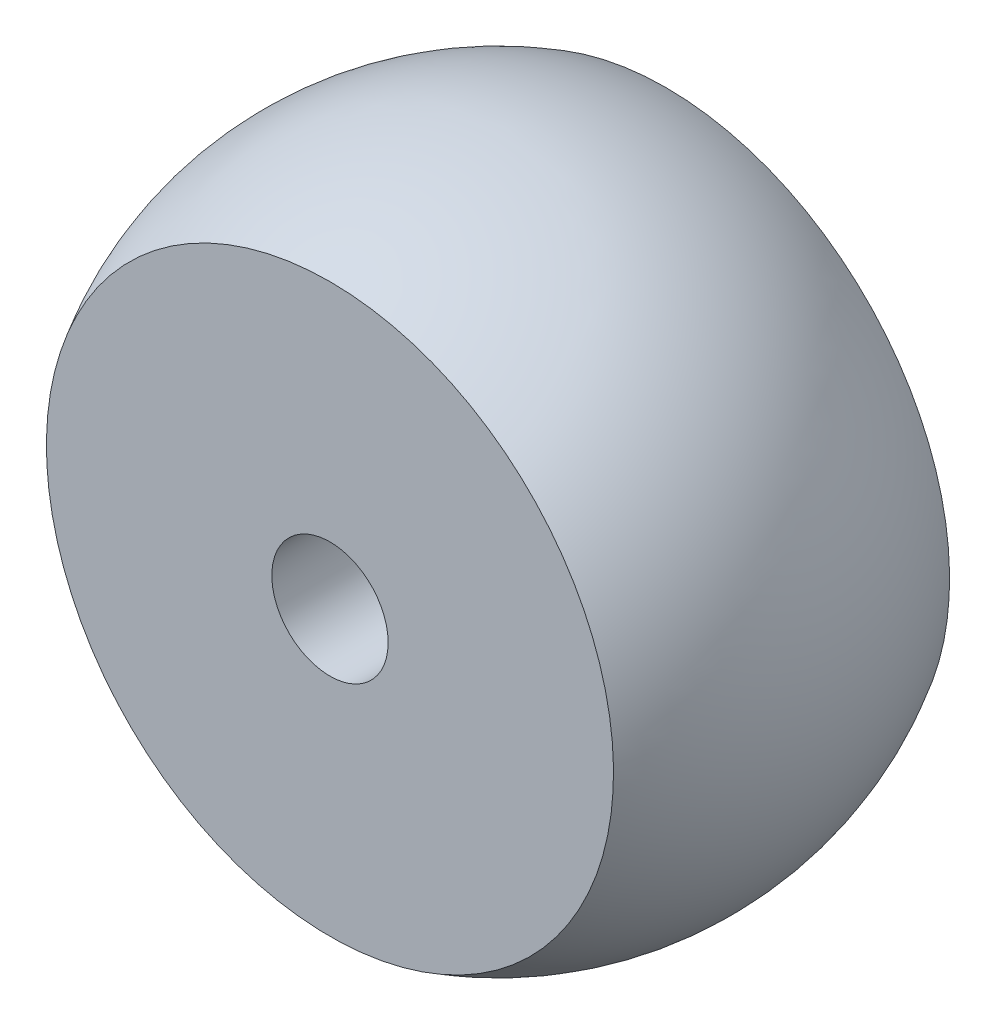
ISO-10303-21;
HEADER;
FILE_DESCRIPTION(('STEP AP214'),'2;1');
FILE_NAME('part.step','',(''),(''),'','','');
FILE_SCHEMA(('AUTOMOTIVE_DESIGN { 1 0 10303 214 1 1 1 1 }'));
ENDSEC;
DATA;
#1=APPLICATION_CONTEXT('core data for automotive mechanical design processes');
#2=APPLICATION_PROTOCOL_DEFINITION('international standard','automotive_design',2000,#1);
#3=PRODUCT_CONTEXT('',#1,'mechanical');
#4=PRODUCT('Part','Part','',(#3));
#5=PRODUCT_RELATED_PRODUCT_CATEGORY('part','',(#4));
#6=PRODUCT_DEFINITION_FORMATION('','',#4);
#7=PRODUCT_DEFINITION_CONTEXT('part definition',#1,'design');
#8=PRODUCT_DEFINITION('design','',#6,#7);
#9=PRODUCT_DEFINITION_SHAPE('','',#8);
#10=(LENGTH_UNIT() NAMED_UNIT(*) SI_UNIT(.MILLI.,.METRE.));
#11=(NAMED_UNIT(*) PLANE_ANGLE_UNIT() SI_UNIT($,.RADIAN.));
#12=(NAMED_UNIT(*) SI_UNIT($,.STERADIAN.) SOLID_ANGLE_UNIT());
#13=UNCERTAINTY_MEASURE_WITH_UNIT(LENGTH_MEASURE(1.E-05),#10,'distance_accuracy_value','');
#14=(GEOMETRIC_REPRESENTATION_CONTEXT(3) GLOBAL_UNCERTAINTY_ASSIGNED_CONTEXT((#13)) GLOBAL_UNIT_ASSIGNED_CONTEXT((#10,
#11,#12)) REPRESENTATION_CONTEXT('',''));
#15=CARTESIAN_POINT('',(0.,0.,0.));
#16=DIRECTION('',(0.,0.,1.));
#17=DIRECTION('',(1.,0.,0.));
#18=AXIS2_PLACEMENT_3D('',#15,#16,#17);
#19=CARTESIAN_POINT('',(0.,0.,6.5));
#20=DIRECTION('',(0.,0.,1.));
#21=DIRECTION('',(1.,0.,0.));
#22=AXIS2_PLACEMENT_3D('',#19,#20,#21);
#23=PLANE('',#22);
#24=CARTESIAN_POINT('',(0.,0.,6.5));
#25=DIRECTION('',(0.,0.,1.));
#26=DIRECTION('',(1.,0.,0.));
#27=AXIS2_PLACEMENT_3D('',#24,#25,#26);
#28=CIRCLE('',#27,2.25);
#29=CARTESIAN_POINT('',(2.25,0.,6.5));
#30=VERTEX_POINT('',#29);
#31=EDGE_CURVE('E45',#30,#30,#28,.T.);
#32=ORIENTED_EDGE('',*,*,#31,.F.);
#33=EDGE_LOOP('',(#32));
#34=FACE_BOUND('',#33,.T.);
#35=CARTESIAN_POINT('',(0.,0.,6.5));
#36=DIRECTION('',(0.,0.,1.));
#37=DIRECTION('',(1.,0.,0.));
#38=AXIS2_PLACEMENT_3D('',#35,#36,#37);
#39=CIRCLE('',#38,10.9687054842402);
#40=CARTESIAN_POINT('',(0.,10.9687054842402,6.5));
#41=VERTEX_POINT('',#40);
#42=EDGE_CURVE('E56',#41,#41,#39,.T.);
#43=ORIENTED_EDGE('',*,*,#42,.T.);
#44=EDGE_LOOP('',(#43));
#45=FACE_BOUND('',#44,.T.);
#46=ADVANCED_FACE('F41',(#34,#45),#23,.T.);
#47=CARTESIAN_POINT('',(0.,0.,-6.5));
#48=DIRECTION('',(0.,0.,1.));
#49=DIRECTION('',(1.,0.,0.));
#50=AXIS2_PLACEMENT_3D('',#47,#48,#49);
#51=PLANE('',#50);
#52=CARTESIAN_POINT('',(0.,0.,-6.5));
#53=DIRECTION('',(0.,0.,1.));
#54=DIRECTION('',(1.,0.,0.));
#55=AXIS2_PLACEMENT_3D('',#52,#53,#54);
#56=CIRCLE('',#55,2.25);
#57=CARTESIAN_POINT('',(2.25,0.,-6.5));
#58=VERTEX_POINT('',#57);
#59=EDGE_CURVE('E11',#58,#58,#56,.T.);
#60=ORIENTED_EDGE('',*,*,#59,.T.);
#61=EDGE_LOOP('',(#60));
#62=FACE_BOUND('',#61,.T.);
#63=CARTESIAN_POINT('',(0.,0.,-6.5));
#64=DIRECTION('',(0.,0.,1.));
#65=DIRECTION('',(1.,0.,0.));
#66=AXIS2_PLACEMENT_3D('',#63,#64,#65);
#67=CIRCLE('',#66,10.9687054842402);
#68=CARTESIAN_POINT('',(0.,10.9687054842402,-6.5));
#69=VERTEX_POINT('',#68);
#70=EDGE_CURVE('E52',#69,#69,#67,.T.);
#71=ORIENTED_EDGE('',*,*,#70,.F.);
#72=EDGE_LOOP('',(#71));
#73=FACE_BOUND('',#72,.T.);
#74=ADVANCED_FACE('F43',(#62,#73),#51,.F.);
#75=CARTESIAN_POINT('',(0.,0.,-6.5));
#76=DIRECTION('',(0.,0.,1.));
#77=DIRECTION('',(1.,0.,0.));
#78=AXIS2_PLACEMENT_3D('',#75,#76,#77);
#79=CYLINDRICAL_SURFACE('',#78,2.25);
#80=CARTESIAN_POINT('',(2.25,0.,-6.5));
#81=CARTESIAN_POINT('',(2.25,0.,-6.36458333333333));
#82=CARTESIAN_POINT('',(2.25,0.,-6.22916666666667));
#83=CARTESIAN_POINT('',(2.25,0.,-5.95833333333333));
#84=CARTESIAN_POINT('',(2.25,0.,-5.82291666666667));
#85=CARTESIAN_POINT('',(2.25,0.,-5.55208333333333));
#86=CARTESIAN_POINT('',(2.25,0.,-5.41666666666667));
#87=CARTESIAN_POINT('',(2.25,0.,-5.14583333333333));
#88=CARTESIAN_POINT('',(2.25,0.,-5.01041666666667));
#89=CARTESIAN_POINT('',(2.25,0.,-4.73958333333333));
#90=CARTESIAN_POINT('',(2.25,0.,-4.60416666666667));
#91=CARTESIAN_POINT('',(2.25,0.,-4.33333333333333));
#92=CARTESIAN_POINT('',(2.25,0.,-4.19791666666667));
#93=CARTESIAN_POINT('',(2.25,0.,-3.92708333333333));
#94=CARTESIAN_POINT('',(2.25,0.,-3.79166666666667));
#95=CARTESIAN_POINT('',(2.25,0.,-3.52083333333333));
#96=CARTESIAN_POINT('',(2.25,0.,-3.38541666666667));
#97=CARTESIAN_POINT('',(2.25,0.,-3.11458333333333));
#98=CARTESIAN_POINT('',(2.25,0.,-2.97916666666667));
#99=CARTESIAN_POINT('',(2.25,0.,-2.70833333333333));
#100=CARTESIAN_POINT('',(2.25,0.,-2.57291666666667));
#101=CARTESIAN_POINT('',(2.25,0.,-2.30208333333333));
#102=CARTESIAN_POINT('',(2.25,0.,-2.16666666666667));
#103=CARTESIAN_POINT('',(2.25,0.,-1.89583333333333));
#104=CARTESIAN_POINT('',(2.25,0.,-1.76041666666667));
#105=CARTESIAN_POINT('',(2.25,0.,-1.48958333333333));
#106=CARTESIAN_POINT('',(2.25,0.,-1.35416666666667));
#107=CARTESIAN_POINT('',(2.25,0.,-1.08333333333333));
#108=CARTESIAN_POINT('',(2.25,0.,-0.947916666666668));
#109=CARTESIAN_POINT('',(2.25,0.,-0.677083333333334));
#110=CARTESIAN_POINT('',(2.25,0.,-0.541666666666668));
#111=CARTESIAN_POINT('',(2.25,0.,-0.270833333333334));
#112=CARTESIAN_POINT('',(2.25,0.,-0.135416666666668));
#113=CARTESIAN_POINT('',(2.25,0.,0.135416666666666));
#114=CARTESIAN_POINT('',(2.25,0.,0.270833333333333));
#115=CARTESIAN_POINT('',(2.25,0.,0.541666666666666));
#116=CARTESIAN_POINT('',(2.25,0.,0.677083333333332));
#117=CARTESIAN_POINT('',(2.25,0.,0.947916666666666));
#118=CARTESIAN_POINT('',(2.25,0.,1.08333333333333));
#119=CARTESIAN_POINT('',(2.25,0.,1.35416666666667));
#120=CARTESIAN_POINT('',(2.25,0.,1.48958333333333));
#121=CARTESIAN_POINT('',(2.25,0.,1.76041666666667));
#122=CARTESIAN_POINT('',(2.25,0.,1.89583333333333));
#123=CARTESIAN_POINT('',(2.25,0.,2.16666666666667));
#124=CARTESIAN_POINT('',(2.25,0.,2.30208333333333));
#125=CARTESIAN_POINT('',(2.25,0.,2.57291666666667));
#126=CARTESIAN_POINT('',(2.25,0.,2.70833333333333));
#127=CARTESIAN_POINT('',(2.25,0.,2.97916666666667));
#128=CARTESIAN_POINT('',(2.25,0.,3.11458333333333));
#129=CARTESIAN_POINT('',(2.25,0.,3.38541666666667));
#130=CARTESIAN_POINT('',(2.25,0.,3.52083333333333));
#131=CARTESIAN_POINT('',(2.25,0.,3.79166666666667));
#132=CARTESIAN_POINT('',(2.25,0.,3.92708333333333));
#133=CARTESIAN_POINT('',(2.25,0.,4.19791666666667));
#134=CARTESIAN_POINT('',(2.25,0.,4.33333333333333));
#135=CARTESIAN_POINT('',(2.25,0.,4.60416666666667));
#136=CARTESIAN_POINT('',(2.25,0.,4.73958333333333));
#137=CARTESIAN_POINT('',(2.25,0.,5.01041666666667));
#138=CARTESIAN_POINT('',(2.25,0.,5.14583333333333));
#139=CARTESIAN_POINT('',(2.25,0.,5.41666666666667));
#140=CARTESIAN_POINT('',(2.25,0.,5.55208333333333));
#141=CARTESIAN_POINT('',(2.25,0.,5.82291666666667));
#142=CARTESIAN_POINT('',(2.25,0.,5.95833333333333));
#143=CARTESIAN_POINT('',(2.25,0.,6.22916666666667));
#144=CARTESIAN_POINT('',(2.25,0.,6.36458333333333));
#145=CARTESIAN_POINT('',(2.25,0.,6.5));
#146=B_SPLINE_CURVE_WITH_KNOTS('',3,(#80,#81,#82,#83,#84,#85,#86,#87,#88,#89,#90,#91,#92,#93,
#94,#95,#96,#97,#98,#99,#100,#101,#102,#103,#104,#105,#106,#107,#108,#109,#110,#111,#112,#113,
#114,#115,#116,#117,#118,#119,#120,#121,#122,#123,#124,#125,#126,#127,#128,#129,#130,#131,#132,
#133,#134,#135,#136,#137,#138,#139,#140,#141,#142,#143,#144,#145),.UNSPECIFIED.,.F.,.F.,(4,2,2,
2,2,2,2,2,2,2,2,2,2,2,2,2,2,2,2,2,2,2,2,2,2,2,2,2,2,2,2,2,4),(0.,0.40625,0.812500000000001,
1.21875,1.625,2.03125,2.4375,2.84375,3.25,3.65625,4.0625,4.46875,4.875,5.28125,5.6875,6.09375,
6.5,6.90625,7.3125,7.71875,8.125,8.53125,8.9375,9.34375,9.75,10.15625,10.5625,10.96875,11.375,
11.78125,12.1875,12.59375,13.),.UNSPECIFIED.);
#147=EDGE_CURVE('BSEAM64',#58,#30,#146,.T.);
#148=ORIENTED_EDGE('',*,*,#59,.F.);
#149=ORIENTED_EDGE('',*,*,#31,.T.);
#150=ORIENTED_EDGE('',*,*,#147,.T.);
#151=ORIENTED_EDGE('',*,*,#147,.F.);
#152=EDGE_LOOP('',(#148,#150,#149,#151));
#153=FACE_BOUND('',#152,.T.);
#154=ADVANCED_FACE('F64',(#153),#79,.F.);
#155=CARTESIAN_POINT('',(0.,0.,0.));
#156=DIRECTION('',(0.,0.,1.));
#157=DIRECTION('',(0.,1.,0.));
#158=AXIS2_PLACEMENT_3D('',#155,#156,#157);
#159=SPHERICAL_SURFACE('',#158,12.75);
#160=CARTESIAN_POINT('',(0.,10.9687054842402,6.5));
#161=CARTESIAN_POINT('',(0.,11.0411483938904,6.37775495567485));
#162=CARTESIAN_POINT('',(0.,11.1115460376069,6.25429796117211));
#163=CARTESIAN_POINT('',(0.,11.2481757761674,6.00510008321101));
#164=CARTESIAN_POINT('',(0.,11.3144078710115,5.87935919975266));
#165=CARTESIAN_POINT('',(0.,11.442631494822,5.62573355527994));
#166=CARTESIAN_POINT('',(0.,11.5046230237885,5.49784879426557));
#167=CARTESIAN_POINT('',(0.,11.6242964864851,5.2400784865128));
#168=CARTESIAN_POINT('',(0.,11.6819784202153,5.11019293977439));
#169=CARTESIAN_POINT('',(0.,11.7929681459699,4.84856620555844));
#170=CARTESIAN_POINT('',(0.,11.8462759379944,4.71682501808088));
#171=CARTESIAN_POINT('',(0.,11.9484578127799,4.45163427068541));
#172=CARTESIAN_POINT('',(0.,11.9973318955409,4.31818471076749));
#173=CARTESIAN_POINT('',(0.,12.0905917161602,4.04972638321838));
#174=CARTESIAN_POINT('',(0.,12.1349774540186,3.91471761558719));
#175=CARTESIAN_POINT('',(0.,12.2192109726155,3.64329178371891));
#176=CARTESIAN_POINT('',(0.,12.2590587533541,3.50687471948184));
#177=CARTESIAN_POINT('',(0.,12.3341718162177,3.2327847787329));
#178=CARTESIAN_POINT('',(0.,12.3694370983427,3.09511190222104));
#179=CARTESIAN_POINT('',(0.,12.4353457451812,2.81866422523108));
#180=CARTESIAN_POINT('',(0.,12.4659891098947,2.67988942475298));
#181=CARTESIAN_POINT('',(0.,12.5226196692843,2.40139301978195));
#182=CARTESIAN_POINT('',(0.,12.5486068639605,2.26167141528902));
#183=CARTESIAN_POINT('',(0.,12.5958960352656,1.98143758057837));
#184=CARTESIAN_POINT('',(0.,12.6171980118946,1.84092535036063));
#185=CARTESIAN_POINT('',(0.,12.6550929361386,1.55926732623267));
#186=CARTESIAN_POINT('',(0.,12.6716858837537,1.41812153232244));
#187=CARTESIAN_POINT('',(0.,12.7001442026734,1.13535415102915));
#188=CARTESIAN_POINT('',(0.,12.712009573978,0.993732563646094));
#189=CARTESIAN_POINT('',(0.,12.7309994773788,0.710171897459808));
#190=CARTESIAN_POINT('',(0.,12.7381240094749,0.568232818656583));
#191=CARTESIAN_POINT('',(0.,12.7476242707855,0.284195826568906));
#192=CARTESIAN_POINT('',(0.,12.75,0.142097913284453));
#193=CARTESIAN_POINT('',(0.,12.75,-0.142097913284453));
#194=CARTESIAN_POINT('',(0.,12.7476242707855,-0.284195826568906));
#195=CARTESIAN_POINT('',(0.,12.7381240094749,-0.568232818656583));
#196=CARTESIAN_POINT('',(0.,12.7309994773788,-0.710171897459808));
#197=CARTESIAN_POINT('',(0.,12.712009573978,-0.993732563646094));
#198=CARTESIAN_POINT('',(0.,12.7001442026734,-1.13535415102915));
#199=CARTESIAN_POINT('',(0.,12.6716858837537,-1.41812153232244));
#200=CARTESIAN_POINT('',(0.,12.6550929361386,-1.55926732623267));
#201=CARTESIAN_POINT('',(0.,12.6171980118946,-1.84092535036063));
#202=CARTESIAN_POINT('',(0.,12.5958960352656,-1.98143758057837));
#203=CARTESIAN_POINT('',(0.,12.5486068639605,-2.26167141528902));
#204=CARTESIAN_POINT('',(0.,12.5226196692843,-2.40139301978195));
#205=CARTESIAN_POINT('',(0.,12.4659891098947,-2.67988942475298));
#206=CARTESIAN_POINT('',(0.,12.4353457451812,-2.81866422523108));
#207=CARTESIAN_POINT('',(0.,12.3694370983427,-3.09511190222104));
#208=CARTESIAN_POINT('',(0.,12.3341718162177,-3.2327847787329));
#209=CARTESIAN_POINT('',(0.,12.2590587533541,-3.50687471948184));
#210=CARTESIAN_POINT('',(0.,12.2192109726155,-3.64329178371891));
#211=CARTESIAN_POINT('',(0.,12.1349774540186,-3.91471761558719));
#212=CARTESIAN_POINT('',(0.,12.0905917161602,-4.04972638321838));
#213=CARTESIAN_POINT('',(0.,11.9973318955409,-4.31818471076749));
#214=CARTESIAN_POINT('',(0.,11.9484578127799,-4.45163427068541));
#215=CARTESIAN_POINT('',(0.,11.8462759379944,-4.71682501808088));
#216=CARTESIAN_POINT('',(0.,11.7929681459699,-4.84856620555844));
#217=CARTESIAN_POINT('',(0.,11.6819784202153,-5.11019293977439));
#218=CARTESIAN_POINT('',(0.,11.6242964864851,-5.2400784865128));
#219=CARTESIAN_POINT('',(0.,11.5046230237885,-5.49784879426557));
#220=CARTESIAN_POINT('',(0.,11.442631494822,-5.62573355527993));
#221=CARTESIAN_POINT('',(0.,11.3144078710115,-5.87935919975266));
#222=CARTESIAN_POINT('',(0.,11.2481757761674,-6.00510008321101));
#223=CARTESIAN_POINT('',(0.,11.1115460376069,-6.25429796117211));
#224=CARTESIAN_POINT('',(0.,11.0411483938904,-6.37775495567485));
#225=CARTESIAN_POINT('',(0.,10.9687054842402,-6.5));
#226=B_SPLINE_CURVE_WITH_KNOTS('',3,(#160,#161,#162,#163,#164,#165,#166,#167,#168,#169,#170,
#171,#172,#173,#174,#175,#176,#177,#178,#179,#180,#181,#182,#183,#184,#185,#186,#187,#188,#189,
#190,#191,#192,#193,#194,#195,#196,#197,#198,#199,#200,#201,#202,#203,#204,#205,#206,#207,#208,
#209,#210,#211,#212,#213,#214,#215,#216,#217,#218,#219,#220,#221,#222,#223,#224,#225),
.UNSPECIFIED.,.F.,.F.,(4,2,2,2,2,2,2,2,2,2,2,2,2,2,2,2,2,2,2,2,2,2,2,2,2,2,2,2,2,2,2,2,4),(0.,
0.426273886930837,0.852547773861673,1.27882166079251,1.70509554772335,2.13136943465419,
2.55764332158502,2.98391720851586,3.4101910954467,3.83646498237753,4.26273886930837,
4.68901275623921,5.11528664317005,5.54156053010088,5.96783441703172,6.39410830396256,
6.82038219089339,7.24665607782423,7.67292996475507,8.09920385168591,8.52547773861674,
8.95175162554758,9.37802551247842,9.80429939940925,10.2305732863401,10.6568471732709,
11.0831210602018,11.5093949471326,11.9356688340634,12.3619427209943,12.7882166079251,
13.2144904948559,13.6407643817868),.UNSPECIFIED.);
#227=EDGE_CURVE('BSEAM61',#41,#69,#226,.T.);
#228=ORIENTED_EDGE('',*,*,#42,.F.);
#229=ORIENTED_EDGE('',*,*,#70,.T.);
#230=ORIENTED_EDGE('',*,*,#227,.T.);
#231=ORIENTED_EDGE('',*,*,#227,.F.);
#232=EDGE_LOOP('',(#228,#230,#229,#231));
#233=FACE_BOUND('',#232,.T.);
#234=ADVANCED_FACE('F61',(#233),#159,.T.);
#235=CLOSED_SHELL('',(#46,#74,#154,#234));
#236=MANIFOLD_SOLID_BREP('B2',#235);
#237=ADVANCED_BREP_SHAPE_REPRESENTATION('',(#18,#236),#14);
#238=SHAPE_DEFINITION_REPRESENTATION(#9,#237);
ENDSEC;
END-ISO-10303-21;
